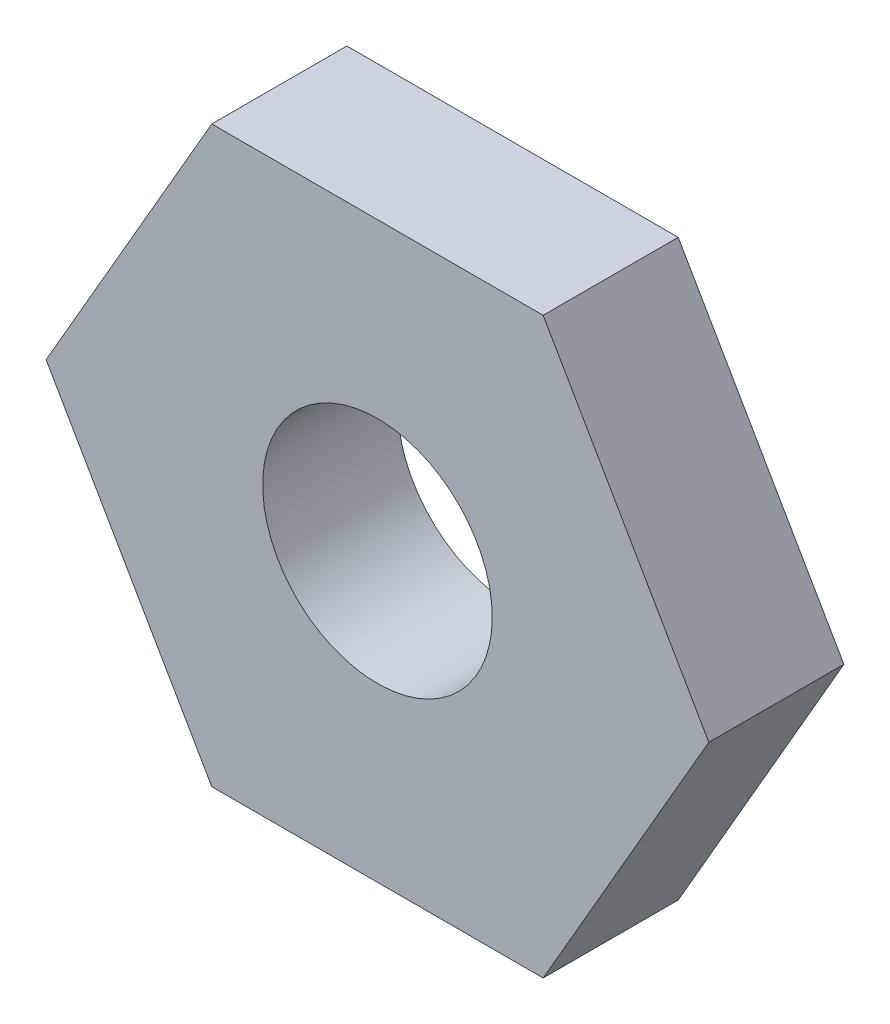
from build123d import *

# Parameters (mm, degrees)
EXTRUSION1_DEPTH       = 4
TROU_TARAUD_M8X1_251_D = 6.8


with BuildPart() as part:
    # Esquisse1 → Extrusion1 (new body)
    with BuildSketch(Plane.XY):
        Polygon((-9.814954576, 0), (-4.907477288, 8.5), (4.907477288, 8.5), (9.814954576, 0), (4.907477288, -8.5), (-4.907477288, -8.5), align=None)
    extrude(amount=EXTRUSION1_DEPTH)

    # Trou taraud_ M8x1.251 (through all)
    with Locations(Plane.XY.offset(4)):
        with Locations((0, 0)):
            Hole(TROU_TARAUD_M8X1_251_D / 2)


solid = part.part
